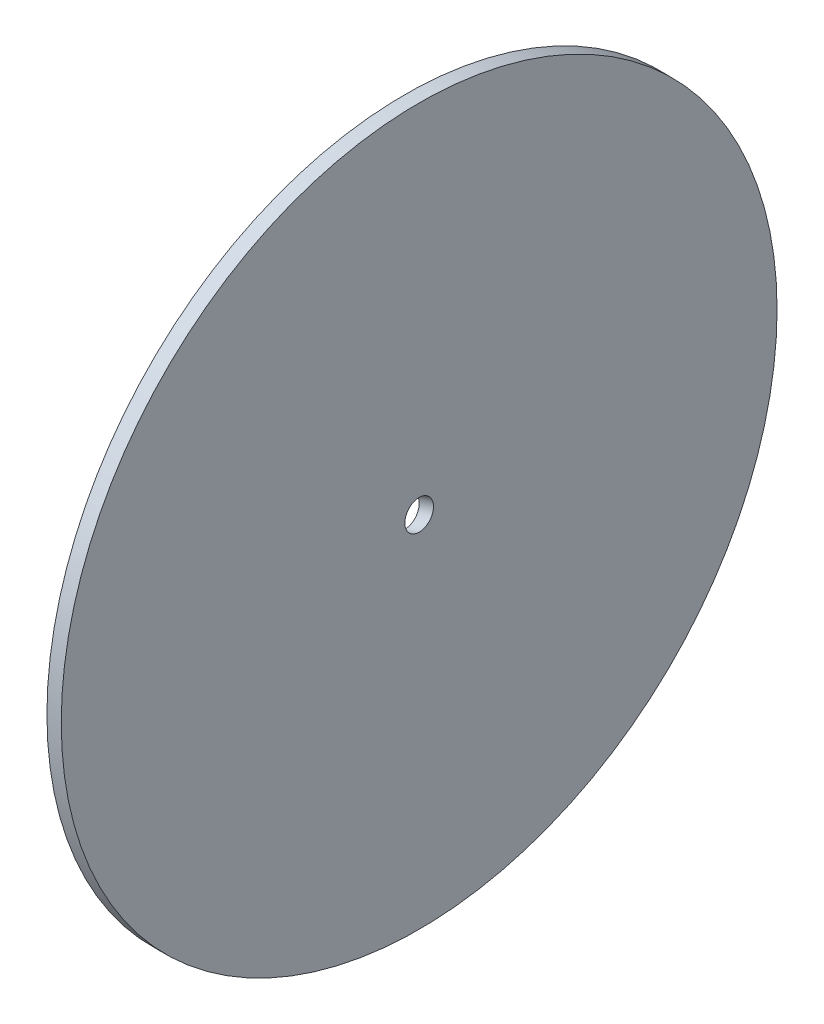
ISO-10303-21;
HEADER;
FILE_DESCRIPTION(('STEP AP214'),'2;1');
FILE_NAME('part.step','',(''),(''),'','','');
FILE_SCHEMA(('AUTOMOTIVE_DESIGN { 1 0 10303 214 1 1 1 1 }'));
ENDSEC;
DATA;
#1=APPLICATION_CONTEXT('core data for automotive mechanical design processes');
#2=APPLICATION_PROTOCOL_DEFINITION('international standard','automotive_design',2000,#1);
#3=PRODUCT_CONTEXT('',#1,'mechanical');
#4=PRODUCT('Part','Part','',(#3));
#5=PRODUCT_RELATED_PRODUCT_CATEGORY('part','',(#4));
#6=PRODUCT_DEFINITION_FORMATION('','',#4);
#7=PRODUCT_DEFINITION_CONTEXT('part definition',#1,'design');
#8=PRODUCT_DEFINITION('design','',#6,#7);
#9=PRODUCT_DEFINITION_SHAPE('','',#8);
#10=(LENGTH_UNIT() NAMED_UNIT(*) SI_UNIT(.MILLI.,.METRE.));
#11=(NAMED_UNIT(*) PLANE_ANGLE_UNIT() SI_UNIT($,.RADIAN.));
#12=(NAMED_UNIT(*) SI_UNIT($,.STERADIAN.) SOLID_ANGLE_UNIT());
#13=UNCERTAINTY_MEASURE_WITH_UNIT(LENGTH_MEASURE(1.E-05),#10,'distance_accuracy_value','');
#14=(GEOMETRIC_REPRESENTATION_CONTEXT(3) GLOBAL_UNCERTAINTY_ASSIGNED_CONTEXT((#13)) GLOBAL_UNIT_ASSIGNED_CONTEXT((#10,
#11,#12)) REPRESENTATION_CONTEXT('',''));
#15=CARTESIAN_POINT('',(0.,0.,0.));
#16=DIRECTION('',(0.,0.,1.));
#17=DIRECTION('',(1.,0.,0.));
#18=AXIS2_PLACEMENT_3D('',#15,#16,#17);
#19=CARTESIAN_POINT('',(2.,0.,0.));
#20=DIRECTION('',(-1.,0.,0.));
#21=DIRECTION('',(0.,0.,1.));
#22=AXIS2_PLACEMENT_3D('',#19,#20,#21);
#23=CYLINDRICAL_SURFACE('',#22,50.);
#24=CARTESIAN_POINT('',(2.,0.,0.));
#25=DIRECTION('',(1.,0.,0.));
#26=DIRECTION('',(0.,0.,-1.));
#27=AXIS2_PLACEMENT_3D('',#24,#25,#26);
#28=CIRCLE('',#27,50.);
#29=CARTESIAN_POINT('',(2.,0.,-50.));
#30=VERTEX_POINT('',#29);
#31=EDGE_CURVE('E11',#30,#30,#28,.T.);
#32=ORIENTED_EDGE('',*,*,#31,.F.);
#33=EDGE_LOOP('',(#32));
#34=FACE_BOUND('',#33,.T.);
#35=CARTESIAN_POINT('',(0.,0.,0.));
#36=DIRECTION('',(1.,0.,0.));
#37=DIRECTION('',(0.,0.,-1.));
#38=AXIS2_PLACEMENT_3D('',#35,#36,#37);
#39=CIRCLE('',#38,50.);
#40=CARTESIAN_POINT('',(0.,0.,-50.));
#41=VERTEX_POINT('',#40);
#42=EDGE_CURVE('E57',#41,#41,#39,.T.);
#43=ORIENTED_EDGE('',*,*,#42,.T.);
#44=EDGE_LOOP('',(#43));
#45=FACE_BOUND('',#44,.T.);
#46=ADVANCED_FACE('F49',(#34,#45),#23,.T.);
#47=CARTESIAN_POINT('',(2.,0.,0.));
#48=DIRECTION('',(1.,0.,0.));
#49=DIRECTION('',(0.,0.,-1.));
#50=AXIS2_PLACEMENT_3D('',#47,#48,#49);
#51=PLANE('',#50);
#52=CARTESIAN_POINT('',(2.,0.162459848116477,0.));
#53=DIRECTION('',(1.,0.,0.));
#54=DIRECTION('',(0.,1.,0.));
#55=AXIS2_PLACEMENT_3D('',#52,#53,#54);
#56=ELLIPSE('',#55,2.10292444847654,2.);
#57=CARTESIAN_POINT('',(2.,2.26538429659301,0.));
#58=VERTEX_POINT('',#57);
#59=EDGE_CURVE('E63',#58,#58,#56,.T.);
#60=ORIENTED_EDGE('',*,*,#59,.F.);
#61=EDGE_LOOP('',(#60));
#62=FACE_BOUND('',#61,.T.);
#63=ORIENTED_EDGE('',*,*,#31,.T.);
#64=EDGE_LOOP('',(#63));
#65=FACE_BOUND('',#64,.T.);
#66=ADVANCED_FACE('F82',(#62,#65),#51,.T.);
#67=CARTESIAN_POINT('',(0.,0.,0.));
#68=DIRECTION('',(1.,0.,0.));
#69=DIRECTION('',(0.,0.,-1.));
#70=AXIS2_PLACEMENT_3D('',#67,#68,#69);
#71=PLANE('',#70);
#72=CARTESIAN_POINT('',(0.,-0.487379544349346,0.));
#73=DIRECTION('',(1.,0.,0.));
#74=DIRECTION('',(0.,1.,0.));
#75=AXIS2_PLACEMENT_3D('',#72,#73,#74);
#76=ELLIPSE('',#75,2.10292444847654,2.);
#77=CARTESIAN_POINT('',(0.,1.61554490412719,0.));
#78=VERTEX_POINT('',#77);
#79=EDGE_CURVE('E52',#78,#78,#76,.T.);
#80=ORIENTED_EDGE('',*,*,#79,.T.);
#81=EDGE_LOOP('',(#80));
#82=FACE_BOUND('',#81,.T.);
#83=ORIENTED_EDGE('',*,*,#42,.F.);
#84=EDGE_LOOP('',(#83));
#85=FACE_BOUND('',#84,.T.);
#86=ADVANCED_FACE('F73',(#82,#85),#71,.F.);
#87=CARTESIAN_POINT('',(-20.4047617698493,-7.11728854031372,0.));
#88=DIRECTION('',(0.951056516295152,0.309016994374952,0.));
#89=DIRECTION('',(-0.309016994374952,0.951056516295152,0.));
#90=AXIS2_PLACEMENT_3D('',#87,#88,#89);
#91=CYLINDRICAL_SURFACE('',#90,2.);
#92=ORIENTED_EDGE('',*,*,#59,.T.);
#93=EDGE_LOOP('',(#92));
#94=FACE_BOUND('',#93,.T.);
#95=ORIENTED_EDGE('',*,*,#79,.F.);
#96=EDGE_LOOP('',(#95));
#97=FACE_BOUND('',#96,.T.);
#98=ADVANCED_FACE('F76',(#94,#97),#91,.F.);
#99=CLOSED_SHELL('',(#46,#66,#86,#98));
#100=MANIFOLD_SOLID_BREP('B2',#99);
#101=ADVANCED_BREP_SHAPE_REPRESENTATION('',(#18,#100),#14);
#102=SHAPE_DEFINITION_REPRESENTATION(#9,#101);
ENDSEC;
END-ISO-10303-21;
